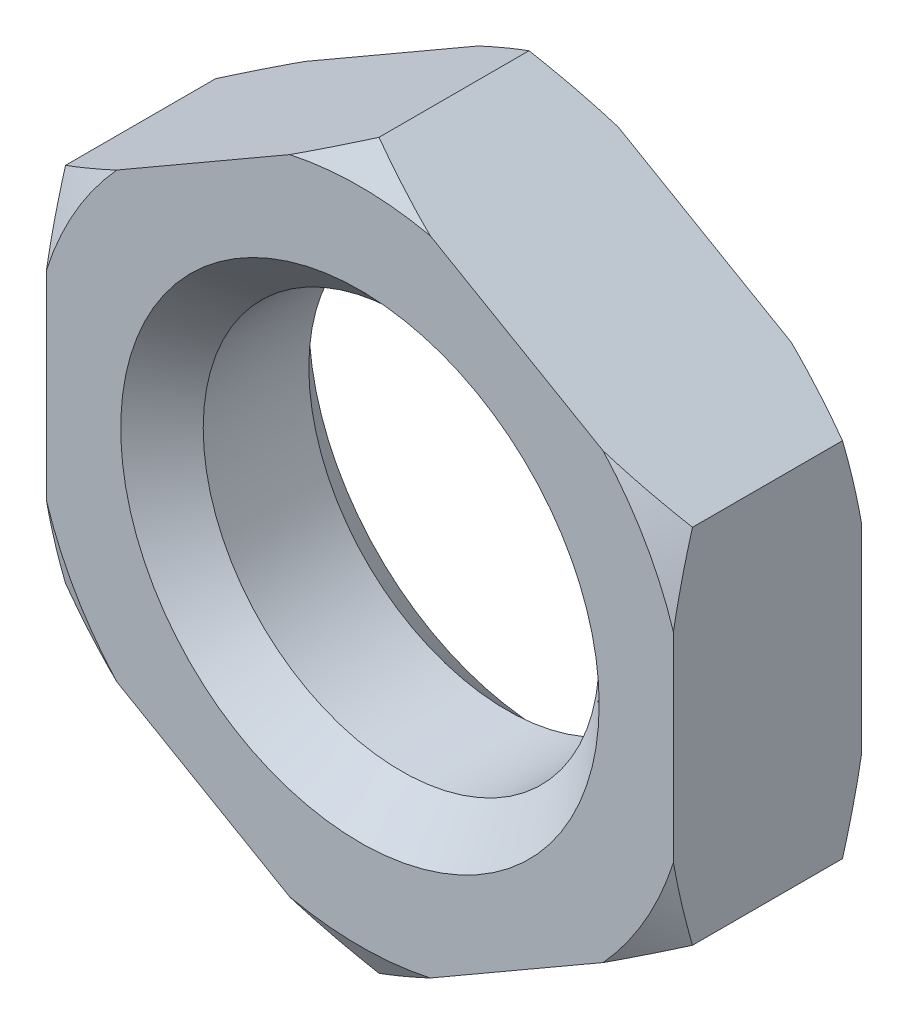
from build123d import *

# Parameters (mm, degrees)
SKETCH1_R           = 6
BOSS_EXTRUDE1_DEPTH = 2.85
CHAMFER1_SIZE       = 1.25


with BuildPart() as part:
    # Sketch1 → Boss-Extrude1 (new, symmetric)
    with BuildSketch(Plane.XY):
        Polygon((0, 10.969655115), (-9.5, 5.484827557), (-9.5, -5.484827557), (0, -10.969655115), (9.5, -5.484827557), (9.5, 5.484827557), align=None)
        Circle(SKETCH1_R, mode=Mode.SUBTRACT)
    extrude(amount=BOSS_EXTRUDE1_DEPTH, both=True)

    # Sketch3 → Cut-Revolve1 (revolve, cut)
    with BuildSketch(Plane(origin=(0, 0, 0), x_dir=(0, 0, -1), z_dir=(1, 0, 0))):
        Polygon((-2.85, 10.969655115), (-2.85, 9.969655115), (-2.272649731, 10.969655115), align=None)
    cut_revolve1 = revolve(axis=Axis((0, 0, -7.477018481), (0, 0, 1)), mode=Mode.SUBTRACT)

    # Mirror1: Cut-Revolve1 across plane
    add(cut_revolve1.mirror(Plane.XY), mode=Mode.SUBTRACT)

    # Chamfer1
    chamfer1_edges = [part.edges().sort_by_distance(p)[0] for p in [
        (-6, 0, -2.85),
        (-6, 0, 2.85),
    ]]
    chamfer(chamfer1_edges, length=CHAMFER1_SIZE)


solid = part.part
